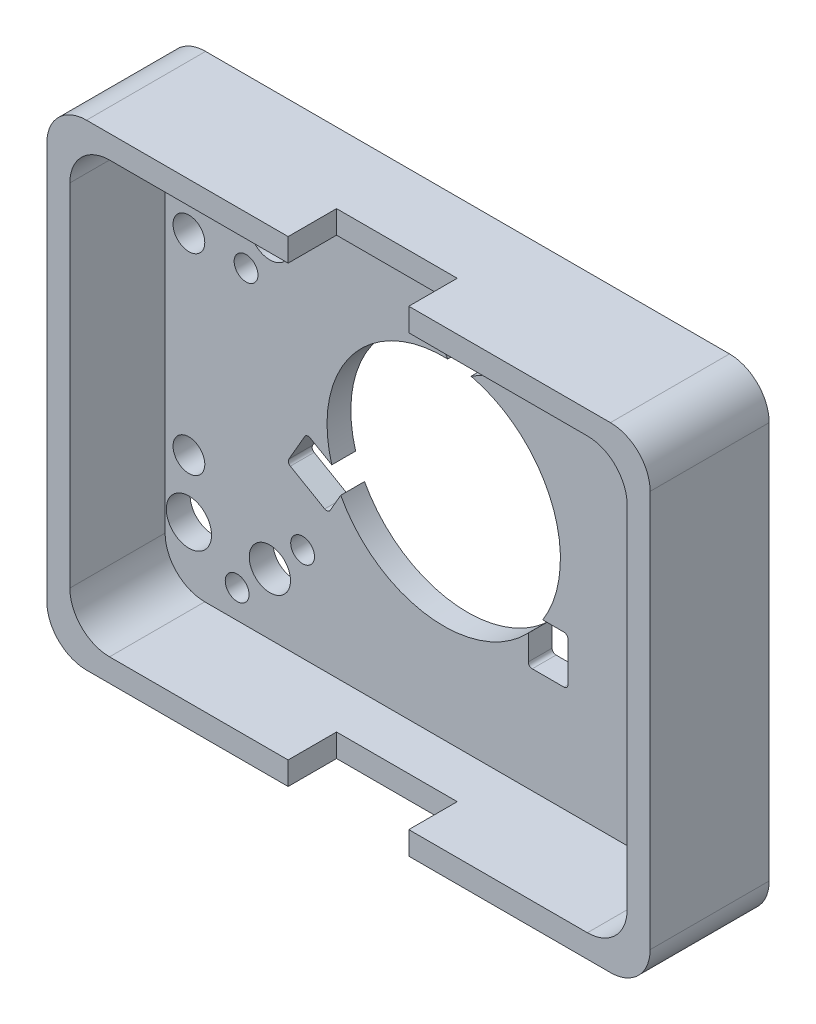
from build123d import *

# Parameters (mm, degrees)
EXTRUDE_1_DEPTH     = 15
CUT_EXTRUDE_1_DEPTH = 12
SKETCH_4_W          = 15.2
SKETCH_4_H          = 2.9
CUT_EXTRUDE_2_DEPTH = 6.1
SKETCH_5_R          = 2.85
SKETCH_5_R_2        = 2
CUT_EXTRUDE_3_DEPTH = 50.879855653
SKETCH_8_R          = 2.6
CUT_EXTRUDE_4_DEPTH = 50.879855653
CUT_EXTRUDE_5_REACH = 52.685
SKETCH_9_R          = 1.5


with BuildPart() as part:
    # Sketch 1 → Extrude 1 (new body)
    with BuildSketch(Plane.XY):
        with BuildLine():
            Line((-33, 30), (33, 30))
            ThreePointArc((33, 30), (36.535533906, 28.535533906), (38, 25))
            Line((38, 25), (38, -25))
            ThreePointArc((38, -25), (36.535533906, -28.535533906), (33, -30))
            Line((33, -30), (-33, -30))
            ThreePointArc((-33, -30), (-36.535533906, -28.535533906), (-38, -25))
            Line((-38, -25), (-38, 25))
            ThreePointArc((-38, 25), (-36.535533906, 28.535533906), (-33, 30))
        make_face()
    extrude(amount=EXTRUDE_1_DEPTH)

    # Sketch 2 → Cut-Extrude 1 (cut)
    with BuildSketch(Plane.XY.offset(15)):
        with BuildLine():
            Line((-30.1, 27.1), (30.1, 27.1))
            ThreePointArc((30.1, 27.1), (33.635533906, 25.635533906), (35.1, 22.1))
            Line((35.1, 22.1), (35.1, -22.1))
            ThreePointArc((35.1, -22.1), (33.635533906, -25.635533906), (30.1, -27.1))
            Line((30.1, -27.1), (-30.1, -27.1))
            ThreePointArc((-30.1, -27.1), (-33.635533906, -25.635533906), (-35.1, -22.1))
            Line((-35.1, -22.1), (-35.1, 22.1))
            ThreePointArc((-35.1, 22.1), (-33.635533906, 25.635533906), (-30.1, 27.1))
        make_face()
    extrude(amount=-CUT_EXTRUDE_1_DEPTH, mode=Mode.SUBTRACT)

    # Sketch 3 → Cut-Revolve 1 (revolve, cut)
    with BuildSketch(Plane(origin=(0, 0, 0), x_dir=(1, 0, 0), z_dir=(0, 1, 0)), mode=Mode.PRIVATE) as cut_revolve_1_sk:
        Polygon((0, -3), (14.7, -3), (14.7, -1.9), (14.7, 0), (0, 0), (0, -1.9), align=None)
    revolve(cut_revolve_1_sk.sketch.rotate(Axis((0, 0, -11.605627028), (0, 0, 1)), 180), axis=Axis((0, 0, -11.605627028), (0, 0, 1)), mode=Mode.SUBTRACT)

    # Sketch 4 → Cut-Extrude 2 (cut)
    with BuildSketch(Plane.XY.offset(15)):
        with Locations((0, 28.55)):
            Rectangle(SKETCH_4_W, SKETCH_4_H)
        with Locations((0, -28.55)):
            Rectangle(SKETCH_4_W, SKETCH_4_H)
    extrude(amount=-CUT_EXTRUDE_2_DEPTH, mode=Mode.SUBTRACT)

    # Sketch 5 → Cut-Extrude 3 (cut, through all)
    with BuildSketch(Plane.XY.offset(3)):
        with BuildLine():
            ThreePointArc((-0.654309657, 17.693297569), (-0.88727257, 17.38969439), (-0.837322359, 17.010284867))
            Line((-0.837322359, 17.010284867), (1.162677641, 13.546183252))
            ThreePointArc((1.162677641, 13.546183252), (1.725099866, 14.279146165), (1.845690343, 13.36317055))
            Line((1.845690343, 13.36317055), (6.175817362, 15.86317055))
            ThreePointArc((6.175817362, 15.86317055), (6.408780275, 16.16677373), (6.358830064, 16.546183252))
            Line((6.358830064, 16.546183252), (4.358830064, 20.010284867))
            ThreePointArc((4.358830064, 20.010284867), (4.055226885, 20.24324778), (3.675817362, 20.193297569))
            Line((3.675817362, 20.193297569), (-0.654309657, 17.693297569))
        make_face()
        with BuildLine():
            Line((-14.312677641, -9.230284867), (-12.312677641, -5.766183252))
            ThreePointArc((-12.312677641, -5.766183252), (-13.228653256, -5.645592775), (-12.495690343, -5.08317055))
            Line((-12.495690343, -5.08317055), (-16.825817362, -2.58317055))
            ThreePointArc((-16.825817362, -2.58317055), (-17.205226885, -2.533220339), (-17.508830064, -2.766183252))
            Line((-17.508830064, -2.766183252), (-19.508830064, -6.230284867))
            ThreePointArc((-19.508830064, -6.230284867), (-19.558780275, -6.60969439), (-19.325817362, -6.913297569))
            Line((-19.325817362, -6.913297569), (-14.995690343, -9.413297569))
            ThreePointArc((-14.995690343, -9.413297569), (-14.616280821, -9.46324778), (-14.312677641, -9.230284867))
        make_face()
        with BuildLine():
            Line((15.15, -7.78), (11.15, -7.78))
            ThreePointArc((11.15, -7.78), (10.796446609, -7.926446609), (10.65, -8.28))
            Line((10.65, -8.28), (10.65, -13.28))
            ThreePointArc((10.65, -13.28), (10.796446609, -13.633553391), (11.15, -13.78))
            Line((11.15, -13.78), (15.15, -13.78))
            ThreePointArc((15.15, -13.78), (15.503553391, -13.633553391), (15.65, -13.28))
            Line((15.65, -13.28), (15.65, -8.28))
            ThreePointArc((15.65, -8.28), (15.503553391, -7.926446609), (15.15, -7.78))
        make_face()
        with Locations((-32.1, 19.4)):
            Circle(SKETCH_5_R)
        with Locations((32.1, 17.9)):
            Circle(SKETCH_5_R)
        with Locations(Location((-32.1, -19.4, 0), (0, 0, 180))):
            Circle(SKETCH_5_R)
        with Locations((32.1, -19.4)):
            Circle(SKETCH_5_R)
        with Locations((-32.1, 12.1)):
            Circle(SKETCH_5_R_2)
        with Locations(Location((32.1, 12.1, 0), (0, 0, 180))):
            Circle(SKETCH_5_R_2)
        with Locations((32.1, -12.1)):
            Circle(SKETCH_5_R_2)
        with Locations(Location((-32.1, -12.1, 0), (0, 0, 180))):
            Circle(SKETCH_5_R_2)
    extrude(amount=-CUT_EXTRUDE_3_DEPTH, mode=Mode.SUBTRACT)

    # Sketch 8 → Cut-Extrude 4 (cut, through all)
    with BuildSketch(Plane.XY.offset(3)):
        with Locations((-21.9, -19.4)):
            Circle(SKETCH_8_R)
        with Locations((21.9, 16.9)):
            Circle(SKETCH_8_R)
        with Locations(Location((-21.9, 16.9, 0), (0, 0, 180))):
            Circle(SKETCH_8_R)
    extrude(amount=-CUT_EXTRUDE_4_DEPTH, mode=Mode.SUBTRACT)

    # Sketch 9 → Cut-Extrude 5 (cut, up to next)
    with BuildSketch(Plane(origin=(0, 0, 0), x_dir=(-1, 0, 0), z_dir=(0, 0, -1)), mode=Mode.PRIVATE) as cut_extrude_5_sk1:
        with Locations((-18.9, 21.9)):
            Circle(SKETCH_9_R)
    cut_extrude_5_tool1 = extrude(cut_extrude_5_sk1.sketch, amount=-CUT_EXTRUDE_5_REACH, mode=Mode.PRIVATE) & part.part
    # Sketch 9 → Cut-Extrude 5 (cut, up to next)
    with BuildSketch(Plane(origin=(0, 0, 0), x_dir=(-1, 0, 0), z_dir=(0, 0, -1)), mode=Mode.PRIVATE) as cut_extrude_5_sk2:
        with Locations((-24.9, 11.9)):
            Circle(SKETCH_9_R)
    cut_extrude_5_tool2 = extrude(cut_extrude_5_sk2.sketch, amount=-CUT_EXTRUDE_5_REACH, mode=Mode.PRIVATE) & part.part
    # Sketch 9 → Cut-Extrude 5 (cut, up to next)
    with BuildSketch(Plane(origin=(0, 0, 0), x_dir=(-1, 0, 0), z_dir=(0, 0, -1)), mode=Mode.PRIVATE) as cut_extrude_5_sk3:
        with Locations((24.9, 11.9)):
            Circle(SKETCH_9_R)
    cut_extrude_5_tool3 = extrude(cut_extrude_5_sk3.sketch, amount=-CUT_EXTRUDE_5_REACH, mode=Mode.PRIVATE) & part.part
    # Sketch 9 → Cut-Extrude 5 (cut, up to next)
    with BuildSketch(Plane(origin=(0, 0, 0), x_dir=(-1, 0, 0), z_dir=(0, 0, -1)), mode=Mode.PRIVATE) as cut_extrude_5_sk4:
        with Locations((18.9, 21.9)):
            Circle(SKETCH_9_R)
    cut_extrude_5_tool4 = extrude(cut_extrude_5_sk4.sketch, amount=-CUT_EXTRUDE_5_REACH, mode=Mode.PRIVATE) & part.part
    # Sketch 9 → Cut-Extrude 5 (cut, up to next)
    with BuildSketch(Plane(origin=(0, 0, 0), x_dir=(-1, 0, 0), z_dir=(0, 0, -1)), mode=Mode.PRIVATE) as cut_extrude_5_sk5:
        with Locations((17.776894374, -15.276894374)):
            Circle(SKETCH_9_R)
    cut_extrude_5_tool5 = extrude(cut_extrude_5_sk5.sketch, amount=-CUT_EXTRUDE_5_REACH, mode=Mode.PRIVATE) & part.part
    # Sketch 9 → Cut-Extrude 5 (cut, up to next)
    with BuildSketch(Plane(origin=(0, 0, 0), x_dir=(-1, 0, 0), z_dir=(0, 0, -1)), mode=Mode.PRIVATE) as cut_extrude_5_sk6:
        with Locations((26.023105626, -23.523105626)):
            Circle(SKETCH_9_R)
    cut_extrude_5_tool6 = extrude(cut_extrude_5_sk6.sketch, amount=-CUT_EXTRUDE_5_REACH, mode=Mode.PRIVATE) & part.part
    add(cut_extrude_5_tool1.solids().sort_by_distance((18.9, 21.9, 0))[0], mode=Mode.SUBTRACT)
    add(cut_extrude_5_tool2.solids().sort_by_distance((24.9, 11.9, 0))[0], mode=Mode.SUBTRACT)
    add(cut_extrude_5_tool3.solids().sort_by_distance((-24.9, 11.9, 0))[0], mode=Mode.SUBTRACT)
    add(cut_extrude_5_tool4.solids().sort_by_distance((-18.9, 21.9, 0))[0], mode=Mode.SUBTRACT)
    add(cut_extrude_5_tool5.solids().sort_by_distance((-17.776894, -15.276894, 0))[0], mode=Mode.SUBTRACT)
    add(cut_extrude_5_tool6.solids().sort_by_distance((-26.023106, -23.523106, 0))[0], mode=Mode.SUBTRACT)


solid = part.part
